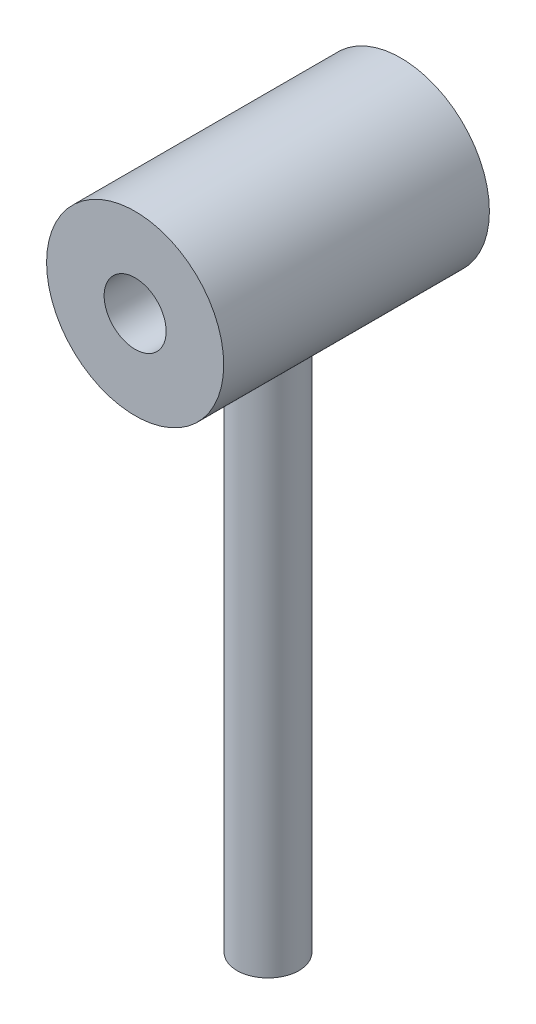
ISO-10303-21;
HEADER;
FILE_DESCRIPTION(('STEP AP214'),'2;1');
FILE_NAME('part.step','',(''),(''),'','','');
FILE_SCHEMA(('AUTOMOTIVE_DESIGN { 1 0 10303 214 1 1 1 1 }'));
ENDSEC;
DATA;
#1=APPLICATION_CONTEXT('core data for automotive mechanical design processes');
#2=APPLICATION_PROTOCOL_DEFINITION('international standard','automotive_design',2000,#1);
#3=PRODUCT_CONTEXT('',#1,'mechanical');
#4=PRODUCT('Part','Part','',(#3));
#5=PRODUCT_RELATED_PRODUCT_CATEGORY('part','',(#4));
#6=PRODUCT_DEFINITION_FORMATION('','',#4);
#7=PRODUCT_DEFINITION_CONTEXT('part definition',#1,'design');
#8=PRODUCT_DEFINITION('design','',#6,#7);
#9=PRODUCT_DEFINITION_SHAPE('','',#8);
#10=(LENGTH_UNIT() NAMED_UNIT(*) SI_UNIT(.MILLI.,.METRE.));
#11=(NAMED_UNIT(*) PLANE_ANGLE_UNIT() SI_UNIT($,.RADIAN.));
#12=(NAMED_UNIT(*) SI_UNIT($,.STERADIAN.) SOLID_ANGLE_UNIT());
#13=UNCERTAINTY_MEASURE_WITH_UNIT(LENGTH_MEASURE(1.E-05),#10,'distance_accuracy_value','');
#14=(GEOMETRIC_REPRESENTATION_CONTEXT(3) GLOBAL_UNCERTAINTY_ASSIGNED_CONTEXT((#13)) GLOBAL_UNIT_ASSIGNED_CONTEXT((#10,
#11,#12)) REPRESENTATION_CONTEXT('',''));
#15=CARTESIAN_POINT('',(0.,0.,0.));
#16=DIRECTION('',(0.,0.,1.));
#17=DIRECTION('',(1.,0.,0.));
#18=AXIS2_PLACEMENT_3D('',#15,#16,#17);
#19=CARTESIAN_POINT('',(0.,70.,0.));
#20=DIRECTION('',(0.,-1.,0.));
#21=DIRECTION('',(0.,0.,-1.));
#22=AXIS2_PLACEMENT_3D('',#19,#20,#21);
#23=CYLINDRICAL_SURFACE('',#22,3.5);
#24=CARTESIAN_POINT('',(0.,0.,0.));
#25=DIRECTION('',(0.,1.,0.));
#26=DIRECTION('',(0.,0.,1.));
#27=AXIS2_PLACEMENT_3D('',#24,#25,#26);
#28=CIRCLE('',#27,3.5);
#29=CARTESIAN_POINT('',(0.,0.,3.5));
#30=VERTEX_POINT('',#29);
#31=EDGE_CURVE('E38',#30,#30,#28,.T.);
#32=ORIENTED_EDGE('',*,*,#31,.T.);
#33=EDGE_LOOP('',(#32));
#34=FACE_BOUND('',#33,.T.);
#35=CARTESIAN_POINT('',(0.,60.,-3.5));
#36=CARTESIAN_POINT('',(-0.190419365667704,59.999997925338,-3.5000029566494));
#37=CARTESIAN_POINT('',(-0.380817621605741,60.0054880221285,-3.48441032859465));
#38=CARTESIAN_POINT('',(-0.755973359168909,60.0268454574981,-3.42266620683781));
#39=CARTESIAN_POINT('',(-0.940730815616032,60.0427128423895,-3.37651457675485));
#40=CARTESIAN_POINT('',(-1.29914235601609,60.0831087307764,-3.25545106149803));
#41=CARTESIAN_POINT('',(-1.47281549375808,60.1076218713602,-3.18059017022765));
#42=CARTESIAN_POINT('',(-1.80513664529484,60.1628310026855,-3.00447488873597));
#43=CARTESIAN_POINT('',(-1.96378123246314,60.1935283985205,-2.90321449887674));
#44=CARTESIAN_POINT('',(-2.26752589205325,60.2591938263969,-2.67317148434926));
#45=CARTESIAN_POINT('',(-2.41198196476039,60.2942715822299,-2.54357008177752));
#46=CARTESIAN_POINT('',(-2.67761185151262,60.3641660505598,-2.26226333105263));
#47=CARTESIAN_POINT('',(-2.79877980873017,60.3989826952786,-2.11055243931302));
#48=CARTESIAN_POINT('',(-3.01822956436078,60.465646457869,-1.78334535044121));
#49=CARTESIAN_POINT('',(-3.11564633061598,60.4973614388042,-1.60723944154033));
#50=CARTESIAN_POINT('',(-3.27919932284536,60.5525475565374,-1.23985540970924));
#51=CARTESIAN_POINT('',(-3.34534622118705,60.5760215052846,-1.04858248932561));
#52=CARTESIAN_POINT('',(-3.442016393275,60.6109056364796,-0.663656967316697));
#53=CARTESIAN_POINT('',(-3.47375567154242,60.6227261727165,-0.470348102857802));
#54=CARTESIAN_POINT('',(-3.5045119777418,60.6341742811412,-0.0808148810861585));
#55=CARTESIAN_POINT('',(-3.50354037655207,60.6338060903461,0.11540843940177));
#56=CARTESIAN_POINT('',(-3.4698409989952,60.6212757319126,0.494549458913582));
#57=CARTESIAN_POINT('',(-3.43873715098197,60.6097166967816,0.677634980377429));
#58=CARTESIAN_POINT('',(-3.34831908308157,60.5770999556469,1.03580240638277));
#59=CARTESIAN_POINT('',(-3.28900115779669,60.5560410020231,1.21088325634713));
#60=CARTESIAN_POINT('',(-3.14284371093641,60.5063938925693,1.55161236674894));
#61=CARTESIAN_POINT('',(-3.05554665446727,60.4776820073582,1.71704555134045));
#62=CARTESIAN_POINT('',(-2.85622688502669,60.4160118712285,2.03141194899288));
#63=CARTESIAN_POINT('',(-2.74419646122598,60.383052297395,2.18033999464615));
#64=CARTESIAN_POINT('',(-2.49093399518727,60.3142675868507,2.46654322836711));
#65=CARTESIAN_POINT('',(-2.34838607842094,60.2783870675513,2.60264324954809));
#66=CARTESIAN_POINT('',(-2.04205684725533,60.2094625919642,2.84932987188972));
#67=CARTESIAN_POINT('',(-1.87827306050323,60.1764189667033,2.95991349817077));
#68=CARTESIAN_POINT('',(-1.53143472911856,60.1163768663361,3.15350599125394));
#69=CARTESIAN_POINT('',(-1.34817380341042,60.0894551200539,3.2361705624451));
#70=CARTESIAN_POINT('',(-0.969175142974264,60.0452511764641,3.36912230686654));
#71=CARTESIAN_POINT('',(-0.773442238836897,60.0279652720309,3.41942193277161));
#72=CARTESIAN_POINT('',(-0.384982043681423,60.0056093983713,3.48406581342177));
#73=CARTESIAN_POINT('',(-0.192549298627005,60.0000011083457,3.49999580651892));
#74=CARTESIAN_POINT('',(0.192296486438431,59.9999988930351,3.50000418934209));
#75=CARTESIAN_POINT('',(0.384709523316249,60.0056028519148,3.48408858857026));
#76=CARTESIAN_POINT('',(0.757512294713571,60.027039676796,3.42209465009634));
#77=CARTESIAN_POINT('',(0.93808952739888,60.0425336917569,3.37701486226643));
#78=CARTESIAN_POINT('',(1.28902504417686,60.0818540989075,3.25924618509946));
#79=CARTESIAN_POINT('',(1.45938200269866,60.105681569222,3.18655372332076));
#80=CARTESIAN_POINT('',(1.790306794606,60.1600957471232,3.01340991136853));
#81=CARTESIAN_POINT('',(1.95047324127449,60.1908512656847,2.91224601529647));
#82=CARTESIAN_POINT('',(2.25205778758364,60.2556648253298,2.68585482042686));
#83=CARTESIAN_POINT('',(2.39346963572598,60.2897239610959,2.56061953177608));
#84=CARTESIAN_POINT('',(2.66095315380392,60.3594916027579,2.28219979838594));
#85=CARTESIAN_POINT('',(2.78589451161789,60.3951968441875,2.12792589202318));
#86=CARTESIAN_POINT('',(3.00828742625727,60.462508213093,1.79985410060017));
#87=CARTESIAN_POINT('',(3.10573801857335,60.4941141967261,1.62605553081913));
#88=CARTESIAN_POINT('',(3.27010981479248,60.5493944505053,1.26333270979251));
#89=CARTESIAN_POINT('',(3.33703039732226,60.5730685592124,1.07440815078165));
#90=CARTESIAN_POINT('',(3.43775166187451,60.6093245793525,0.686934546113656));
#91=CARTESIAN_POINT('',(3.47156933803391,60.6219121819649,0.488390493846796));
#92=CARTESIAN_POINT('',(3.50371939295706,60.6338793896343,0.0993796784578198));
#93=CARTESIAN_POINT('',(3.50394730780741,60.6339645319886,-0.0909102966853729));
#94=CARTESIAN_POINT('',(3.47365100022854,60.6226867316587,-0.468662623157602));
#95=CARTESIAN_POINT('',(3.44312898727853,60.6113246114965,-0.656125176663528));
#96=CARTESIAN_POINT('',(3.35359653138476,60.578983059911,-1.01855095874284));
#97=CARTESIAN_POINT('',(3.29526105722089,60.5582320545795,-1.19370296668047));
#98=CARTESIAN_POINT('',(3.15232119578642,60.5095551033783,-1.53185809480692));
#99=CARTESIAN_POINT('',(3.06771062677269,60.4816274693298,-1.69485834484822));
#100=CARTESIAN_POINT('',(2.86997020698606,60.4201012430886,-2.0124345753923));
#101=CARTESIAN_POINT('',(2.75568240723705,60.3862971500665,-2.16624940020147));
#102=CARTESIAN_POINT('',(2.50372401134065,60.3176243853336,-2.45312762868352));
#103=CARTESIAN_POINT('',(2.36604648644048,60.2827554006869,-2.58618486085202));
#104=CARTESIAN_POINT('',(2.06385316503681,60.2140133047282,-2.83378378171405));
#105=CARTESIAN_POINT('',(1.89841397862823,60.1802540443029,-2.94723445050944));
#106=CARTESIAN_POINT('',(1.54966762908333,60.1192197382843,-3.14462349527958));
#107=CARTESIAN_POINT('',(1.36636283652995,60.0919438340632,-3.22856577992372));
#108=CARTESIAN_POINT('',(0.9890298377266,60.047237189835,-3.36325721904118));
#109=CARTESIAN_POINT('',(0.795139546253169,60.0297028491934,-3.41435660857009));
#110=CARTESIAN_POINT('',(0.400823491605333,60.0060873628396,-3.48272048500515));
#111=CARTESIAN_POINT('',(0.20040005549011,60.0000021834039,-3.49999688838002));
#112=CARTESIAN_POINT('',(0.,60.,-3.5));
#113=B_SPLINE_CURVE_WITH_KNOTS('',3,(#35,#36,#37,#38,#39,#40,#41,#42,#43,#44,#45,#46,#47,#48,
#49,#50,#51,#52,#53,#54,#55,#56,#57,#58,#59,#60,#61,#62,#63,#64,#65,#66,#67,#68,#69,#70,#71,#72,
#73,#74,#75,#76,#77,#78,#79,#80,#81,#82,#83,#84,#85,#86,#87,#88,#89,#90,#91,#92,#93,#94,#95,#96,
#97,#98,#99,#100,#101,#102,#103,#104,#105,#106,#107,#108,#109,#110,#111,#112),.UNSPECIFIED.,.T.,
.F.,(4,2,2,2,2,2,2,2,2,2,2,2,2,2,2,2,2,2,2,2,2,2,2,2,2,2,2,2,2,2,2,2,2,2,2,2,2,2,4),(0.,
0.570519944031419,1.14104243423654,1.71055621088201,2.28019953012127,2.86921290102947,
3.45837421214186,4.06655384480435,4.67452575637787,5.26023033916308,5.84573132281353,
6.40133800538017,6.95701767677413,7.5222923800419,8.08774356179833,8.68595781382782,
9.28424177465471,9.88965514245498,10.4948354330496,11.0714375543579,11.6479308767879,
12.2056613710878,12.7634640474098,13.336703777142,13.9101341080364,14.5124257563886,
15.1147385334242,15.7170635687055,16.319079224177,16.8871081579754,17.4550962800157,
18.0099524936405,18.5649393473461,19.1461307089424,19.7274945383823,20.3347978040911,
20.9420205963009,21.5426555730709,22.143078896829),.UNSPECIFIED.);
#114=CARTESIAN_POINT('',(0.,60.,-3.5));
#115=VERTEX_POINT('',#114);
#116=EDGE_CURVE('E10',#115,#115,#113,.T.);
#117=ORIENTED_EDGE('',*,*,#116,.F.);
#118=EDGE_LOOP('',(#117));
#119=FACE_BOUND('',#118,.T.);
#120=ADVANCED_FACE('F30',(#34,#119),#23,.T.);
#121=CARTESIAN_POINT('',(0.,0.,0.));
#122=DIRECTION('',(0.,1.,0.));
#123=DIRECTION('',(0.,0.,1.));
#124=AXIS2_PLACEMENT_3D('',#121,#122,#123);
#125=PLANE('',#124);
#126=ORIENTED_EDGE('',*,*,#31,.F.);
#127=EDGE_LOOP('',(#126));
#128=FACE_BOUND('',#127,.T.);
#129=ADVANCED_FACE('F53',(#128),#125,.F.);
#130=CARTESIAN_POINT('',(0.,70.,15.));
#131=DIRECTION('',(0.,0.,-1.));
#132=DIRECTION('',(-1.,0.,0.));
#133=AXIS2_PLACEMENT_3D('',#130,#131,#132);
#134=CYLINDRICAL_SURFACE('',#133,10.);
#135=CARTESIAN_POINT('',(0.,70.,-15.));
#136=DIRECTION('',(0.,0.,1.));
#137=DIRECTION('',(1.,0.,0.));
#138=AXIS2_PLACEMENT_3D('',#135,#136,#137);
#139=CIRCLE('',#138,10.);
#140=CARTESIAN_POINT('',(10.,70.,-15.));
#141=VERTEX_POINT('',#140);
#142=EDGE_CURVE('E111',#141,#141,#139,.T.);
#143=ORIENTED_EDGE('',*,*,#142,.T.);
#144=EDGE_LOOP('',(#143));
#145=FACE_BOUND('',#144,.T.);
#146=CARTESIAN_POINT('',(0.,70.,15.));
#147=DIRECTION('',(0.,0.,1.));
#148=DIRECTION('',(1.,0.,0.));
#149=AXIS2_PLACEMENT_3D('',#146,#147,#148);
#150=CIRCLE('',#149,10.);
#151=CARTESIAN_POINT('',(10.,70.,15.));
#152=VERTEX_POINT('',#151);
#153=EDGE_CURVE('E42',#152,#152,#150,.T.);
#154=ORIENTED_EDGE('',*,*,#153,.F.);
#155=EDGE_LOOP('',(#154));
#156=FACE_BOUND('',#155,.T.);
#157=ORIENTED_EDGE('',*,*,#116,.T.);
#158=EDGE_LOOP('',(#157));
#159=FACE_BOUND('',#158,.T.);
#160=ADVANCED_FACE('F48',(#145,#156,#159),#134,.T.);
#161=CARTESIAN_POINT('',(0.,70.,15.));
#162=DIRECTION('',(0.,0.,1.));
#163=DIRECTION('',(1.,0.,0.));
#164=AXIS2_PLACEMENT_3D('',#161,#162,#163);
#165=PLANE('',#164);
#166=CARTESIAN_POINT('',(0.,70.,15.));
#167=DIRECTION('',(0.,0.,1.));
#168=DIRECTION('',(1.,0.,0.));
#169=AXIS2_PLACEMENT_3D('',#166,#167,#168);
#170=CIRCLE('',#169,3.5);
#171=CARTESIAN_POINT('',(3.5,70.,15.));
#172=VERTEX_POINT('',#171);
#173=EDGE_CURVE('E108',#172,#172,#170,.T.);
#174=ORIENTED_EDGE('',*,*,#173,.F.);
#175=EDGE_LOOP('',(#174));
#176=FACE_BOUND('',#175,.T.);
#177=ORIENTED_EDGE('',*,*,#153,.T.);
#178=EDGE_LOOP('',(#177));
#179=FACE_BOUND('',#178,.T.);
#180=ADVANCED_FACE('F52',(#176,#179),#165,.T.);
#181=CARTESIAN_POINT('',(0.,70.,-15.));
#182=DIRECTION('',(0.,0.,1.));
#183=DIRECTION('',(1.,0.,0.));
#184=AXIS2_PLACEMENT_3D('',#181,#182,#183);
#185=PLANE('',#184);
#186=CARTESIAN_POINT('',(0.,70.,-15.));
#187=DIRECTION('',(0.,0.,1.));
#188=DIRECTION('',(1.,0.,0.));
#189=AXIS2_PLACEMENT_3D('',#186,#187,#188);
#190=CIRCLE('',#189,3.5);
#191=CARTESIAN_POINT('',(3.5,70.,-15.));
#192=VERTEX_POINT('',#191);
#193=EDGE_CURVE('E34',#192,#192,#190,.T.);
#194=ORIENTED_EDGE('',*,*,#193,.T.);
#195=EDGE_LOOP('',(#194));
#196=FACE_BOUND('',#195,.T.);
#197=ORIENTED_EDGE('',*,*,#142,.F.);
#198=EDGE_LOOP('',(#197));
#199=FACE_BOUND('',#198,.T.);
#200=ADVANCED_FACE('F83',(#196,#199),#185,.F.);
#201=CARTESIAN_POINT('',(0.,70.,-25.));
#202=DIRECTION('',(0.,0.,1.));
#203=DIRECTION('',(1.,0.,0.));
#204=AXIS2_PLACEMENT_3D('',#201,#202,#203);
#205=CYLINDRICAL_SURFACE('',#204,3.5);
#206=ORIENTED_EDGE('',*,*,#173,.T.);
#207=EDGE_LOOP('',(#206));
#208=FACE_BOUND('',#207,.T.);
#209=ORIENTED_EDGE('',*,*,#193,.F.);
#210=EDGE_LOOP('',(#209));
#211=FACE_BOUND('',#210,.T.);
#212=ADVANCED_FACE('F92',(#208,#211),#205,.F.);
#213=CLOSED_SHELL('',(#120,#129,#160,#180,#200,#212));
#214=MANIFOLD_SOLID_BREP('B2',#213);
#215=ADVANCED_BREP_SHAPE_REPRESENTATION('',(#18,#214),#14);
#216=SHAPE_DEFINITION_REPRESENTATION(#9,#215);
ENDSEC;
END-ISO-10303-21;
